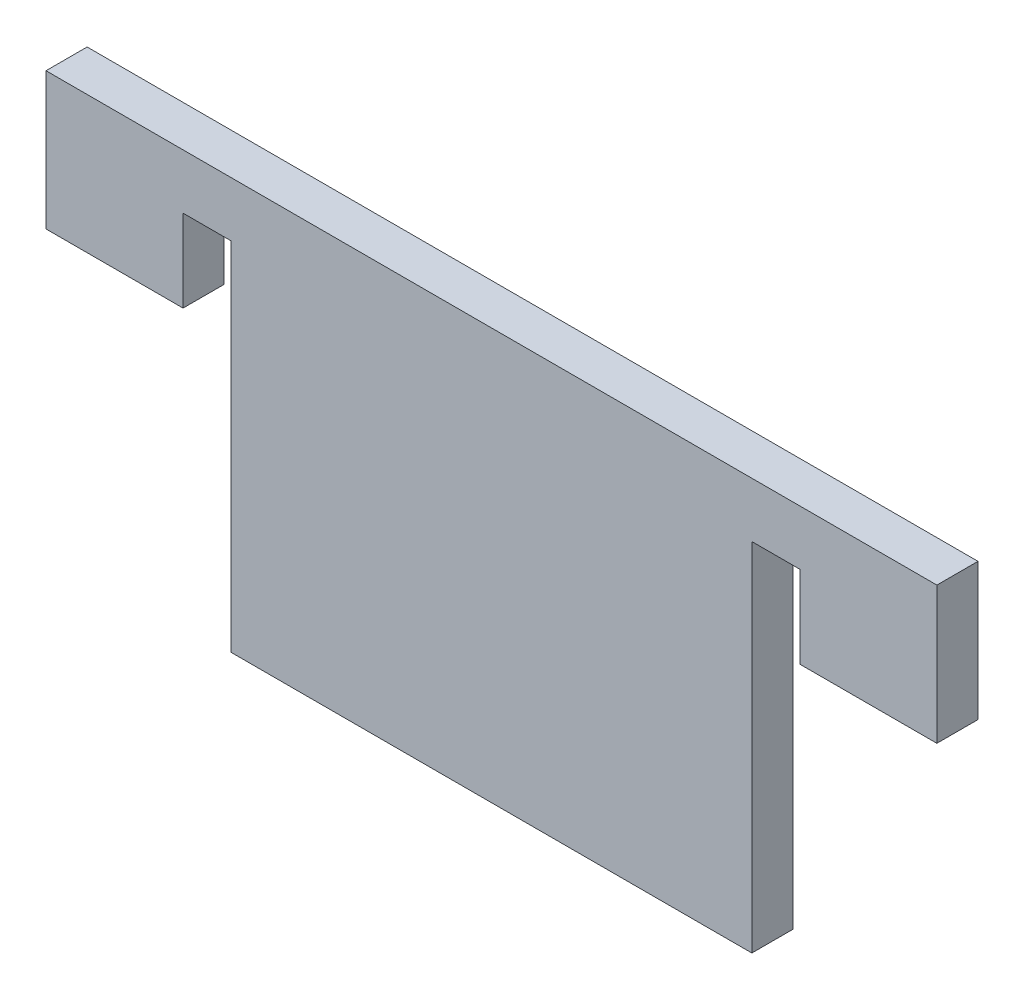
from build123d import *

# Parameters (mm, degrees)
ESQUISSE1_W             = 65
ESQUISSE1_H             = 30
EXTRUSION1_DEPTH        = 3
ESQUISSE2_W             = 13.5
ESQUISSE2_H             = 20
ENL_V_MAT_EXTRU_1_DEPTH = 3
ESQUISSE3_W             = 3.5
ESQUISSE3_H             = 6
ENL_V_MAT_EXTRU_2_DEPTH = 3


with BuildPart() as part:
    # Esquisse1 → Extrusion1 (new body)
    with BuildSketch(Plane.XY):
        with Locations((32.5, 15)):
            Rectangle(ESQUISSE1_W, ESQUISSE1_H)
    extrude(amount=EXTRUSION1_DEPTH)

    # Esquisse2 → Enl_v. mat.-Extru.1 (cut)
    with BuildSketch(Plane.XY.offset(3)):
        with Locations((6.75, 10)):
            Rectangle(ESQUISSE2_W, ESQUISSE2_H)
        with Locations((58.25, 10)):
            Rectangle(ESQUISSE2_W, ESQUISSE2_H)
    extrude(amount=-ENL_V_MAT_EXTRU_1_DEPTH, mode=Mode.SUBTRACT)

    # Esquisse3 → Enl_v. mat.-Extru.2 (cut)
    with BuildSketch(Plane.XY.offset(3)):
        with Locations((11.75, 23)):
            Rectangle(ESQUISSE3_W, ESQUISSE3_H)
        with Locations((53.25, 23)):
            Rectangle(ESQUISSE3_W, ESQUISSE3_H)
    extrude(amount=-ENL_V_MAT_EXTRU_2_DEPTH, mode=Mode.SUBTRACT)


solid = part.part
